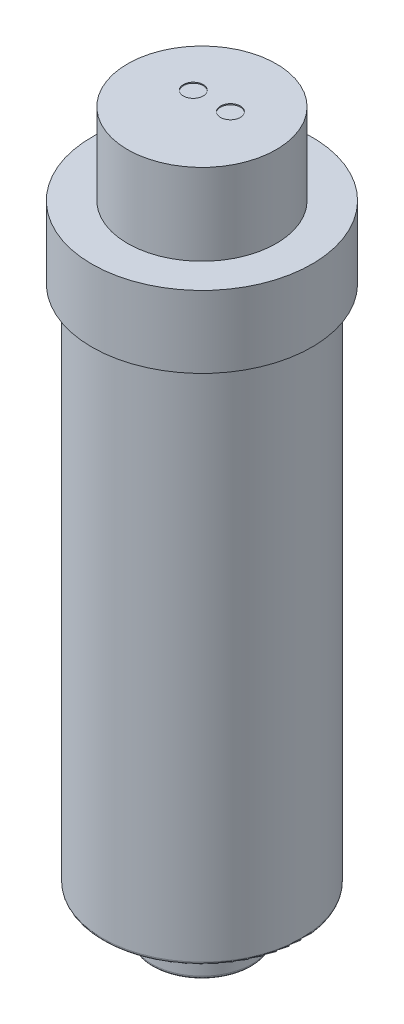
ISO-10303-21;
HEADER;
FILE_DESCRIPTION(('STEP AP214'),'2;1');
FILE_NAME('part.step','',(''),(''),'','','');
FILE_SCHEMA(('AUTOMOTIVE_DESIGN { 1 0 10303 214 1 1 1 1 }'));
ENDSEC;
DATA;
#1=APPLICATION_CONTEXT('core data for automotive mechanical design processes');
#2=APPLICATION_PROTOCOL_DEFINITION('international standard','automotive_design',2000,#1);
#3=PRODUCT_CONTEXT('',#1,'mechanical');
#4=PRODUCT('Part','Part','',(#3));
#5=PRODUCT_RELATED_PRODUCT_CATEGORY('part','',(#4));
#6=PRODUCT_DEFINITION_FORMATION('','',#4);
#7=PRODUCT_DEFINITION_CONTEXT('part definition',#1,'design');
#8=PRODUCT_DEFINITION('design','',#6,#7);
#9=PRODUCT_DEFINITION_SHAPE('','',#8);
#10=(LENGTH_UNIT() NAMED_UNIT(*) SI_UNIT(.MILLI.,.METRE.));
#11=(NAMED_UNIT(*) PLANE_ANGLE_UNIT() SI_UNIT($,.RADIAN.));
#12=(NAMED_UNIT(*) SI_UNIT($,.STERADIAN.) SOLID_ANGLE_UNIT());
#13=UNCERTAINTY_MEASURE_WITH_UNIT(LENGTH_MEASURE(1.E-05),#10,'distance_accuracy_value','');
#14=(GEOMETRIC_REPRESENTATION_CONTEXT(3) GLOBAL_UNCERTAINTY_ASSIGNED_CONTEXT((#13)) GLOBAL_UNIT_ASSIGNED_CONTEXT((#10,
#11,#12)) REPRESENTATION_CONTEXT('',''));
#15=CARTESIAN_POINT('',(0.,0.,0.));
#16=DIRECTION('',(0.,0.,1.));
#17=DIRECTION('',(1.,0.,0.));
#18=AXIS2_PLACEMENT_3D('',#15,#16,#17);
#19=CARTESIAN_POINT('',(0.,0.,0.));
#20=DIRECTION('',(0.,1.,0.));
#21=DIRECTION('',(0.,0.,1.));
#22=AXIS2_PLACEMENT_3D('',#19,#20,#21);
#23=PLANE('',#22);
#24=CARTESIAN_POINT('',(0.,0.,0.));
#25=DIRECTION('',(0.,1.,0.));
#26=DIRECTION('',(0.,0.,1.));
#27=AXIS2_PLACEMENT_3D('',#24,#25,#26);
#28=CIRCLE('',#27,24.63165);
#29=CARTESIAN_POINT('',(0.,0.,24.63165));
#30=VERTEX_POINT('',#29);
#31=EDGE_CURVE('E51',#30,#30,#28,.F.);
#32=ORIENTED_EDGE('',*,*,#31,.T.);
#33=EDGE_LOOP('',(#32));
#34=FACE_BOUND('',#33,.T.);
#35=CARTESIAN_POINT('',(0.,0.,0.));
#36=DIRECTION('',(0.,1.,0.));
#37=DIRECTION('',(0.,0.,1.));
#38=AXIS2_PLACEMENT_3D('',#35,#36,#37);
#39=CIRCLE('',#38,13.55725);
#40=CARTESIAN_POINT('',(0.,0.,13.55725));
#41=VERTEX_POINT('',#40);
#42=EDGE_CURVE('E56',#41,#41,#39,.T.);
#43=ORIENTED_EDGE('',*,*,#42,.T.);
#44=EDGE_LOOP('',(#43));
#45=FACE_BOUND('',#44,.T.);
#46=ADVANCED_FACE('F36',(#34,#45),#23,.F.);
#47=CARTESIAN_POINT('',(0.,151.765,0.));
#48=DIRECTION('',(0.,1.,0.));
#49=DIRECTION('',(0.,0.,1.));
#50=AXIS2_PLACEMENT_3D('',#47,#48,#49);
#51=PLANE('',#50);
#52=CARTESIAN_POINT('',(0.,151.765,0.));
#53=DIRECTION('',(0.,1.,0.));
#54=DIRECTION('',(0.,0.,1.));
#55=AXIS2_PLACEMENT_3D('',#52,#53,#54);
#56=CIRCLE('',#55,28.194);
#57=CARTESIAN_POINT('',(0.,151.765,28.194));
#58=VERTEX_POINT('',#57);
#59=EDGE_CURVE('E260',#58,#58,#56,.T.);
#60=ORIENTED_EDGE('',*,*,#59,.T.);
#61=EDGE_LOOP('',(#60));
#62=FACE_BOUND('',#61,.T.);
#63=CARTESIAN_POINT('',(0.,151.765,0.));
#64=DIRECTION('',(0.,1.,0.));
#65=DIRECTION('',(0.,0.,1.));
#66=AXIS2_PLACEMENT_3D('',#63,#64,#65);
#67=CIRCLE('',#66,19.05);
#68=CARTESIAN_POINT('',(0.,151.765,19.05));
#69=VERTEX_POINT('',#68);
#70=EDGE_CURVE('E266',#69,#69,#67,.T.);
#71=ORIENTED_EDGE('',*,*,#70,.F.);
#72=EDGE_LOOP('',(#71));
#73=FACE_BOUND('',#72,.T.);
#74=ADVANCED_FACE('F92',(#62,#73),#51,.T.);
#75=CARTESIAN_POINT('',(0.,133.35,0.));
#76=DIRECTION('',(0.,-1.,0.));
#77=DIRECTION('',(0.,0.,-1.));
#78=AXIS2_PLACEMENT_3D('',#75,#76,#77);
#79=CYLINDRICAL_SURFACE('',#78,25.4254);
#80=CARTESIAN_POINT('',(0.,0.79375000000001,0.));
#81=DIRECTION('',(0.,1.,0.));
#82=DIRECTION('',(0.,0.,1.));
#83=AXIS2_PLACEMENT_3D('',#80,#81,#82);
#84=CIRCLE('',#83,25.4254);
#85=CARTESIAN_POINT('',(0.,0.79375000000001,25.4254));
#86=VERTEX_POINT('',#85);
#87=EDGE_CURVE('E59',#86,#86,#84,.T.);
#88=ORIENTED_EDGE('',*,*,#87,.T.);
#89=EDGE_LOOP('',(#88));
#90=FACE_BOUND('',#89,.T.);
#91=CARTESIAN_POINT('',(0.,133.35,0.));
#92=DIRECTION('',(0.,1.,0.));
#93=DIRECTION('',(0.,0.,1.));
#94=AXIS2_PLACEMENT_3D('',#91,#92,#93);
#95=CIRCLE('',#94,25.4254);
#96=CARTESIAN_POINT('',(0.,133.35,25.4254));
#97=VERTEX_POINT('',#96);
#98=EDGE_CURVE('E62',#97,#97,#95,.T.);
#99=ORIENTED_EDGE('',*,*,#98,.F.);
#100=EDGE_LOOP('',(#99));
#101=FACE_BOUND('',#100,.T.);
#102=ADVANCED_FACE('F98',(#90,#101),#79,.T.);
#103=CARTESIAN_POINT('',(0.,133.35,0.));
#104=DIRECTION('',(0.,1.,0.));
#105=DIRECTION('',(0.,0.,1.));
#106=AXIS2_PLACEMENT_3D('',#103,#104,#105);
#107=PLANE('',#106);
#108=CARTESIAN_POINT('',(0.,133.35,0.));
#109=DIRECTION('',(0.,1.,0.));
#110=DIRECTION('',(0.,0.,1.));
#111=AXIS2_PLACEMENT_3D('',#108,#109,#110);
#112=CIRCLE('',#111,28.194);
#113=CARTESIAN_POINT('',(0.,133.35,28.194));
#114=VERTEX_POINT('',#113);
#115=EDGE_CURVE('E256',#114,#114,#112,.T.);
#116=ORIENTED_EDGE('',*,*,#115,.F.);
#117=EDGE_LOOP('',(#116));
#118=FACE_BOUND('',#117,.T.);
#119=ORIENTED_EDGE('',*,*,#98,.T.);
#120=EDGE_LOOP('',(#119));
#121=FACE_BOUND('',#120,.T.);
#122=ADVANCED_FACE('F108',(#118,#121),#107,.F.);
#123=CARTESIAN_POINT('',(0.,151.765,0.));
#124=DIRECTION('',(0.,-1.,0.));
#125=DIRECTION('',(0.,0.,-1.));
#126=AXIS2_PLACEMENT_3D('',#123,#124,#125);
#127=CYLINDRICAL_SURFACE('',#126,28.194);
#128=ORIENTED_EDGE('',*,*,#59,.F.);
#129=EDGE_LOOP('',(#128));
#130=FACE_BOUND('',#129,.T.);
#131=ORIENTED_EDGE('',*,*,#115,.T.);
#132=EDGE_LOOP('',(#131));
#133=FACE_BOUND('',#132,.T.);
#134=ADVANCED_FACE('F104',(#130,#133),#127,.T.);
#135=CARTESIAN_POINT('',(0.,172.593,0.));
#136=DIRECTION('',(0.,-1.,0.));
#137=DIRECTION('',(0.,0.,-1.));
#138=AXIS2_PLACEMENT_3D('',#135,#136,#137);
#139=CYLINDRICAL_SURFACE('',#138,19.05);
#140=CARTESIAN_POINT('',(0.,172.593,0.));
#141=DIRECTION('',(0.,1.,0.));
#142=DIRECTION('',(0.,0.,1.));
#143=AXIS2_PLACEMENT_3D('',#140,#141,#142);
#144=CIRCLE('',#143,19.05);
#145=CARTESIAN_POINT('',(0.,172.593,19.05));
#146=VERTEX_POINT('',#145);
#147=EDGE_CURVE('E264',#146,#146,#144,.T.);
#148=ORIENTED_EDGE('',*,*,#147,.F.);
#149=EDGE_LOOP('',(#148));
#150=FACE_BOUND('',#149,.T.);
#151=ORIENTED_EDGE('',*,*,#70,.T.);
#152=EDGE_LOOP('',(#151));
#153=FACE_BOUND('',#152,.T.);
#154=ADVANCED_FACE('F217',(#150,#153),#139,.T.);
#155=CARTESIAN_POINT('',(0.,172.593,0.));
#156=DIRECTION('',(0.,1.,0.));
#157=DIRECTION('',(0.,0.,1.));
#158=AXIS2_PLACEMENT_3D('',#155,#156,#157);
#159=PLANE('',#158);
#160=CARTESIAN_POINT('',(4.7625,172.593,-2.54));
#161=DIRECTION('',(0.,1.,0.));
#162=DIRECTION('',(0.,0.,1.));
#163=AXIS2_PLACEMENT_3D('',#160,#161,#162);
#164=CIRCLE('',#163,2.54);
#165=CARTESIAN_POINT('',(4.7625,172.593,0.));
#166=VERTEX_POINT('',#165);
#167=EDGE_CURVE('E70',#166,#166,#164,.T.);
#168=ORIENTED_EDGE('',*,*,#167,.F.);
#169=EDGE_LOOP('',(#168));
#170=FACE_BOUND('',#169,.T.);
#171=CARTESIAN_POINT('',(-4.7625,172.593,-2.54));
#172=DIRECTION('',(0.,1.,0.));
#173=DIRECTION('',(0.,0.,1.));
#174=AXIS2_PLACEMENT_3D('',#171,#172,#173);
#175=CIRCLE('',#174,2.54);
#176=CARTESIAN_POINT('',(-4.7625,172.593,0.));
#177=VERTEX_POINT('',#176);
#178=EDGE_CURVE('E272',#177,#177,#175,.T.);
#179=ORIENTED_EDGE('',*,*,#178,.F.);
#180=EDGE_LOOP('',(#179));
#181=FACE_BOUND('',#180,.T.);
#182=ORIENTED_EDGE('',*,*,#147,.T.);
#183=EDGE_LOOP('',(#182));
#184=FACE_BOUND('',#183,.T.);
#185=ADVANCED_FACE('F207',(#170,#181,#184),#159,.T.);
#186=CARTESIAN_POINT('',(-4.7625,172.339,-2.54));
#187=DIRECTION('',(0.,1.,0.));
#188=DIRECTION('',(0.,0.,1.));
#189=AXIS2_PLACEMENT_3D('',#186,#187,#188);
#190=CYLINDRICAL_SURFACE('',#189,2.54);
#191=CARTESIAN_POINT('',(-4.7625,172.339,-2.54));
#192=DIRECTION('',(0.,1.,0.));
#193=DIRECTION('',(0.,0.,1.));
#194=AXIS2_PLACEMENT_3D('',#191,#192,#193);
#195=CIRCLE('',#194,2.54);
#196=CARTESIAN_POINT('',(-4.7625,172.339,0.));
#197=VERTEX_POINT('',#196);
#198=EDGE_CURVE('E269',#197,#197,#195,.T.);
#199=ORIENTED_EDGE('',*,*,#198,.F.);
#200=EDGE_LOOP('',(#199));
#201=FACE_BOUND('',#200,.T.);
#202=ORIENTED_EDGE('',*,*,#178,.T.);
#203=EDGE_LOOP('',(#202));
#204=FACE_BOUND('',#203,.T.);
#205=ADVANCED_FACE('F197',(#201,#204),#190,.F.);
#206=CARTESIAN_POINT('',(-4.7625,172.339,-2.54));
#207=DIRECTION('',(0.,1.,0.));
#208=DIRECTION('',(0.,0.,1.));
#209=AXIS2_PLACEMENT_3D('',#206,#207,#208);
#210=PLANE('',#209);
#211=ORIENTED_EDGE('',*,*,#198,.T.);
#212=EDGE_LOOP('',(#211));
#213=FACE_BOUND('',#212,.T.);
#214=ADVANCED_FACE('F187',(#213),#210,.T.);
#215=CARTESIAN_POINT('',(4.7625,172.339,-2.54));
#216=DIRECTION('',(0.,1.,0.));
#217=DIRECTION('',(0.,0.,1.));
#218=AXIS2_PLACEMENT_3D('',#215,#216,#217);
#219=CYLINDRICAL_SURFACE('',#218,2.54);
#220=CARTESIAN_POINT('',(4.7625,172.339,-2.54));
#221=DIRECTION('',(0.,1.,0.));
#222=DIRECTION('',(0.,0.,1.));
#223=AXIS2_PLACEMENT_3D('',#220,#221,#222);
#224=CIRCLE('',#223,2.54);
#225=CARTESIAN_POINT('',(4.7625,172.339,0.));
#226=VERTEX_POINT('',#225);
#227=EDGE_CURVE('E275',#226,#226,#224,.T.);
#228=ORIENTED_EDGE('',*,*,#227,.F.);
#229=EDGE_LOOP('',(#228));
#230=FACE_BOUND('',#229,.T.);
#231=ORIENTED_EDGE('',*,*,#167,.T.);
#232=EDGE_LOOP('',(#231));
#233=FACE_BOUND('',#232,.T.);
#234=ADVANCED_FACE('F178',(#230,#233),#219,.F.);
#235=CARTESIAN_POINT('',(4.7625,172.339,-2.54));
#236=DIRECTION('',(0.,1.,0.));
#237=DIRECTION('',(0.,0.,1.));
#238=AXIS2_PLACEMENT_3D('',#235,#236,#237);
#239=PLANE('',#238);
#240=ORIENTED_EDGE('',*,*,#227,.T.);
#241=EDGE_LOOP('',(#240));
#242=FACE_BOUND('',#241,.T.);
#243=ADVANCED_FACE('F90',(#242),#239,.T.);
#244=CARTESIAN_POINT('',(0.,-12.065,0.));
#245=DIRECTION('',(0.,1.,0.));
#246=DIRECTION('',(0.,0.,1.));
#247=AXIS2_PLACEMENT_3D('',#244,#245,#246);
#248=CYLINDRICAL_SURFACE('',#247,12.7635);
#249=CARTESIAN_POINT('',(0.,-0.793749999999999,0.));
#250=DIRECTION('',(0.,1.,0.));
#251=DIRECTION('',(0.,0.,1.));
#252=AXIS2_PLACEMENT_3D('',#249,#250,#251);
#253=CIRCLE('',#252,12.7635);
#254=CARTESIAN_POINT('',(0.,-0.793749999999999,12.7635));
#255=VERTEX_POINT('',#254);
#256=EDGE_CURVE('E43',#255,#255,#253,.F.);
#257=ORIENTED_EDGE('',*,*,#256,.T.);
#258=EDGE_LOOP('',(#257));
#259=FACE_BOUND('',#258,.T.);
#260=CARTESIAN_POINT('',(0.,-11.27125,0.));
#261=DIRECTION('',(0.,-1.,0.));
#262=DIRECTION('',(0.,0.,-1.));
#263=AXIS2_PLACEMENT_3D('',#260,#261,#262);
#264=CIRCLE('',#263,12.7635);
#265=CARTESIAN_POINT('',(0.,-11.27125,-12.7635));
#266=VERTEX_POINT('',#265);
#267=EDGE_CURVE('E47',#266,#266,#264,.F.);
#268=ORIENTED_EDGE('',*,*,#267,.T.);
#269=EDGE_LOOP('',(#268));
#270=FACE_BOUND('',#269,.T.);
#271=CARTESIAN_POINT('',(0.,-9.0551,12.7635));
#272=CARTESIAN_POINT('',(-0.184256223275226,-9.05509537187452,12.763497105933));
#273=CARTESIAN_POINT('',(-0.368562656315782,-9.03980211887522,12.7594706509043));
#274=CARTESIAN_POINT('',(-0.731874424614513,-8.9791363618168,12.7437990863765));
#275=CARTESIAN_POINT('',(-0.910877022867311,-8.93374860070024,12.7321501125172));
#276=CARTESIAN_POINT('',(-1.25828367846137,-8.81446427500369,12.7025205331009));
#277=CARTESIAN_POINT('',(-1.42670080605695,-8.74060370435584,12.6845479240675));
#278=CARTESIAN_POINT('',(-1.74875630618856,-8.56660176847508,12.644174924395));
#279=CARTESIAN_POINT('',(-1.90239383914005,-8.46645891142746,12.6217742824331));
#280=CARTESIAN_POINT('',(-2.19397048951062,-8.24036634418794,12.5744067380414));
#281=CARTESIAN_POINT('',(-2.33153136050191,-8.1139377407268,12.5493972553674));
#282=CARTESIAN_POINT('',(-2.58375949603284,-7.83988672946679,12.4999070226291));
#283=CARTESIAN_POINT('',(-2.69842392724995,-7.69226170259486,12.4754263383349));
#284=CARTESIAN_POINT('',(-2.90342857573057,-7.37701427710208,12.4293318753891));
#285=CARTESIAN_POINT('',(-2.99333731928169,-7.20910270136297,12.4077719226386));
#286=CARTESIAN_POINT('',(-3.14350063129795,-6.85989180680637,12.3705845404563));
#287=CARTESIAN_POINT('',(-3.20376044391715,-6.67859486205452,12.354956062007));
#288=CARTESIAN_POINT('',(-3.29160878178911,-6.31193966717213,12.3318401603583));
#289=CARTESIAN_POINT('',(-3.31988137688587,-6.12675630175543,12.3241825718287));
#290=CARTESIAN_POINT('',(-3.34508484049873,-5.75412878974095,12.3173667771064));
#291=CARTESIAN_POINT('',(-3.34202133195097,-5.56668505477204,12.3182070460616));
#292=CARTESIAN_POINT('',(-3.30518345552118,-5.20016730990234,12.3281395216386));
#293=CARTESIAN_POINT('',(-3.27223295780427,-5.02100354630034,12.3370103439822));
#294=CARTESIAN_POINT('',(-3.17787437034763,-4.67084010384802,12.3616504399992));
#295=CARTESIAN_POINT('',(-3.11646408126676,-4.49984105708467,12.3774202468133));
#296=CARTESIAN_POINT('',(-2.96624846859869,-4.16869481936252,12.4142787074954));
#297=CARTESIAN_POINT('',(-2.87715122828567,-4.00868656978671,12.4354235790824));
#298=CARTESIAN_POINT('',(-2.67429465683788,-3.70560076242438,12.4806189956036));
#299=CARTESIAN_POINT('',(-2.56053063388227,-3.56252643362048,12.5046700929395));
#300=CARTESIAN_POINT('',(-2.30734054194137,-3.29265832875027,12.5538927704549));
#301=CARTESIAN_POINT('',(-2.16722157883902,-3.16651583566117,12.5790758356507));
#302=CARTESIAN_POINT('',(-1.86751249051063,-2.93938865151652,12.6270474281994));
#303=CARTESIAN_POINT('',(-1.7079216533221,-2.83840488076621,12.6498358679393));
#304=CARTESIAN_POINT('',(-1.37281465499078,-2.66418958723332,12.6905823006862));
#305=CARTESIAN_POINT('',(-1.19723655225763,-2.59107223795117,12.708520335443));
#306=CARTESIAN_POINT('',(-0.835704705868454,-2.47557786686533,12.7374003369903));
#307=CARTESIAN_POINT('',(-0.649753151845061,-2.43319438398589,12.7483437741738));
#308=CARTESIAN_POINT('',(-0.278314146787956,-2.38138492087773,12.761780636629));
#309=CARTESIAN_POINT('',(-0.0929582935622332,-2.37107303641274,12.7645011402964));
#310=CARTESIAN_POINT('',(0.276833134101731,-2.38125805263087,12.7618366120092));
#311=CARTESIAN_POINT('',(0.461268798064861,-2.40175189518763,12.7564523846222));
#312=CARTESIAN_POINT('',(0.820847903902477,-2.47223882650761,12.7383297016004));
#313=CARTESIAN_POINT('',(0.996094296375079,-2.52174108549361,12.7257136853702));
#314=CARTESIAN_POINT('',(1.33578103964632,-2.64827253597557,12.6945555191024));
#315=CARTESIAN_POINT('',(1.50022024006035,-2.72530465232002,12.6760127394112));
#316=CARTESIAN_POINT('',(1.81709225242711,-2.90637474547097,12.6345221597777));
#317=CARTESIAN_POINT('',(1.96923683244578,-3.01089901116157,12.6114972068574));
#318=CARTESIAN_POINT('',(2.25413866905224,-3.24337191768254,12.5637054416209));
#319=CARTESIAN_POINT('',(2.38689223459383,-3.37132500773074,12.5389382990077));
#320=CARTESIAN_POINT('',(2.63295189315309,-3.65115172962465,12.489623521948));
#321=CARTESIAN_POINT('',(2.74563397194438,-3.80357931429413,12.4650999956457));
#322=CARTESIAN_POINT('',(2.94382912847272,-4.12569480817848,12.4197897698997));
#323=CARTESIAN_POINT('',(3.02934336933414,-4.2953819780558,12.3990029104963));
#324=CARTESIAN_POINT('',(3.17013184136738,-4.64632934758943,12.3637561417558));
#325=CARTESIAN_POINT('',(3.22558309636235,-4.8275146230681,12.3492592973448));
#326=CARTESIAN_POINT('',(3.30510643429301,-5.19707927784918,12.3282167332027));
#327=CARTESIAN_POINT('',(3.3291861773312,-5.38545688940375,12.3216690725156));
#328=CARTESIAN_POINT('',(3.34485442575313,-5.7576822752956,12.317424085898));
#329=CARTESIAN_POINT('',(3.33744412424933,-5.94148543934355,12.3194540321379));
#330=CARTESIAN_POINT('',(3.29265560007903,-6.3051232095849,12.331499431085));
#331=CARTESIAN_POINT('',(3.2552780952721,-6.48495791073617,12.3415146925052));
#332=CARTESIAN_POINT('',(3.1521866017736,-6.83434612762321,12.3682430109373));
#333=CARTESIAN_POINT('',(3.08667734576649,-7.00396401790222,12.3849076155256));
#334=CARTESIAN_POINT('',(2.92934161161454,-7.32992784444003,12.4230597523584));
#335=CARTESIAN_POINT('',(2.83751114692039,-7.48627176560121,12.444548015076));
#336=CARTESIAN_POINT('',(2.62707364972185,-7.78604671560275,12.4906890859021));
#337=CARTESIAN_POINT('',(2.50777987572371,-7.92898455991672,12.5154144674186));
#338=CARTESIAN_POINT('',(2.24711797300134,-8.19313846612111,12.5648302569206));
#339=CARTESIAN_POINT('',(2.10574452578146,-8.31434927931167,12.5895206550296));
#340=CARTESIAN_POINT('',(1.80146098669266,-8.53402975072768,12.6366856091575));
#341=CARTESIAN_POINT('',(1.63817084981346,-8.63198586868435,12.6591047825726));
#342=CARTESIAN_POINT('',(1.29686226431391,-8.79890179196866,12.6986023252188));
#343=CARTESIAN_POINT('',(1.11885370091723,-8.86788087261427,12.7156842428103));
#344=CARTESIAN_POINT('',(0.784498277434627,-8.96550640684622,12.7402765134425));
#345=CARTESIAN_POINT('',(0.629640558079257,-8.99902764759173,12.7489229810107));
#346=CARTESIAN_POINT('',(0.31653403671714,-9.04382541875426,12.7605357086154));
#347=CARTESIAN_POINT('',(0.158285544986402,-9.05510397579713,12.7635024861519));
#348=CARTESIAN_POINT('',(0.,-9.0551,12.7635));
#349=B_SPLINE_CURVE_WITH_KNOTS('',3,(#271,#272,#273,#274,#275,#276,#277,#278,#279,#280,#281,
#282,#283,#284,#285,#286,#287,#288,#289,#290,#291,#292,#293,#294,#295,#296,#297,#298,#299,#300,
#301,#302,#303,#304,#305,#306,#307,#308,#309,#310,#311,#312,#313,#314,#315,#316,#317,#318,#319,
#320,#321,#322,#323,#324,#325,#326,#327,#328,#329,#330,#331,#332,#333,#334,#335,#336,#337,#338,
#339,#340,#341,#342,#343,#344,#345,#346,#347,#348),.UNSPECIFIED.,.T.,.F.,(4,2,2,2,2,2,2,2,2,2,2,
2,2,2,2,2,2,2,2,2,2,2,2,2,2,2,2,2,2,2,2,2,2,2,2,2,2,2,4),(0.,0.552188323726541,1.10465680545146,
1.65642916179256,2.20823284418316,2.77114385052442,3.33412447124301,3.90637237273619,
4.478519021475,5.03818385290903,5.59774826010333,6.1423413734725,6.6869765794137,
7.23756099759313,7.78825023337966,8.35620948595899,8.92418951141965,9.49447225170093,
10.0646350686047,10.6189018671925,11.1731136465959,11.718208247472,12.2633607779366,
12.81889353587,13.3745319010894,13.9452174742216,14.5158786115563,15.083141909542,
15.6502666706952,16.1994974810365,16.7487151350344,17.2940017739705,17.8393710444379,
18.4002377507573,18.9612397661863,19.5336695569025,20.1057179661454,20.5801192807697,
21.0544773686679),.UNSPECIFIED.);
#350=CARTESIAN_POINT('',(0.,-9.0551,12.7635));
#351=VERTEX_POINT('',#350);
#352=EDGE_CURVE('E63',#351,#351,#349,.T.);
#353=ORIENTED_EDGE('',*,*,#352,.T.);
#354=EDGE_LOOP('',(#353));
#355=FACE_BOUND('',#354,.T.);
#356=CARTESIAN_POINT('',(3.3401,-5.715,-12.3187119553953));
#357=CARTESIAN_POINT('',(3.34009530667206,-5.53086561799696,-12.3187152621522));
#358=CARTESIAN_POINT('',(3.32482157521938,-5.34668089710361,-12.3228856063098));
#359=CARTESIAN_POINT('',(3.26424037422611,-4.98362155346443,-12.3390687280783));
#360=CARTESIAN_POINT('',(3.21891710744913,-4.80474977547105,-12.3510856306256));
#361=CARTESIAN_POINT('',(3.09982123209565,-4.45762066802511,-12.3815097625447));
#362=CARTESIAN_POINT('',(3.0260876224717,-4.28934915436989,-12.3999082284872));
#363=CARTESIAN_POINT('',(2.85238525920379,-3.96754060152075,-12.4410113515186));
#364=CARTESIAN_POINT('',(2.75241474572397,-3.81400455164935,-12.4637162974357));
#365=CARTESIAN_POINT('',(2.52650153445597,-3.52232587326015,-12.5114869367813));
#366=CARTESIAN_POINT('',(2.40004112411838,-3.38459079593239,-12.5365932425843));
#367=CARTESIAN_POINT('',(2.12585181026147,-3.13202287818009,-12.5859866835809));
#368=CARTESIAN_POINT('',(1.97812077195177,-3.01719233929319,-12.6102737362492));
#369=CARTESIAN_POINT('',(1.66276808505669,-2.81200340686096,-12.6557441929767));
#370=CARTESIAN_POINT('',(1.49487537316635,-2.72204872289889,-12.6768740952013));
#371=CARTESIAN_POINT('',(1.14570473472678,-2.57179541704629,-12.7131843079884));
#372=CARTESIAN_POINT('',(0.964428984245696,-2.51149198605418,-12.7283655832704));
#373=CARTESIAN_POINT('',(0.597890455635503,-2.42356784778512,-12.7507808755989));
#374=CARTESIAN_POINT('',(0.41280436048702,-2.39525422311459,-12.7581831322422));
#375=CARTESIAN_POINT('',(0.0403711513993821,-2.36993490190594,-12.7647939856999));
#376=CARTESIAN_POINT('',(-0.146975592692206,-2.37292415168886,-12.7640039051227));
#377=CARTESIAN_POINT('',(-0.513794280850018,-2.40963459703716,-12.7544429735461));
#378=CARTESIAN_POINT('',(-0.693346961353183,-2.44260737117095,-12.7458664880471));
#379=CARTESIAN_POINT('',(-1.04427622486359,-2.53714164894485,-12.7219248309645));
#380=CARTESIAN_POINT('',(-1.21565234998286,-2.59870475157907,-12.7065592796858));
#381=CARTESIAN_POINT('',(-1.54729295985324,-2.74925542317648,-12.670474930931));
#382=CARTESIAN_POINT('',(-1.70743396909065,-2.8385024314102,-12.6497058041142));
#383=CARTESIAN_POINT('',(-2.01072393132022,-3.04168911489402,-12.6050567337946));
#384=CARTESIAN_POINT('',(-2.15386967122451,-3.1556334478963,-12.5811762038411));
#385=CARTESIAN_POINT('',(-2.42357193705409,-3.40896532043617,-12.5320628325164));
#386=CARTESIAN_POINT('',(-2.54951216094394,-3.54900602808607,-12.506810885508));
#387=CARTESIAN_POINT('',(-2.77626673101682,-3.84848219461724,-12.4584411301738));
#388=CARTESIAN_POINT('',(-2.87707965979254,-4.00791874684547,-12.4353234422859));
#389=CARTESIAN_POINT('',(-3.05116409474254,-4.34295815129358,-12.3937654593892));
#390=CARTESIAN_POINT('',(-3.1242739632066,-4.51864865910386,-12.3753528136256));
#391=CARTESIAN_POINT('',(-3.23972032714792,-4.88042822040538,-12.3456363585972));
#392=CARTESIAN_POINT('',(-3.28206413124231,-5.06651479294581,-12.3343308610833));
#393=CARTESIAN_POINT('',(-3.33372614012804,-5.43805504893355,-12.3204668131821));
#394=CARTESIAN_POINT('',(-3.34396121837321,-5.62337232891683,-12.3176655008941));
#395=CARTESIAN_POINT('',(-3.33363651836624,-5.99306937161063,-12.3204638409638));
#396=CARTESIAN_POINT('',(-3.3130798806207,-6.17744922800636,-12.3260626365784));
#397=CARTESIAN_POINT('',(-3.2425622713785,-6.5365441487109,-12.3447964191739));
#398=CARTESIAN_POINT('',(-3.19314714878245,-6.71137441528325,-12.3577913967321));
#399=CARTESIAN_POINT('',(-3.06692641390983,-7.05026685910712,-12.389717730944));
#400=CARTESIAN_POINT('',(-2.99011732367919,-7.21432766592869,-12.4086498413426));
#401=CARTESIAN_POINT('',(-2.80941007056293,-7.53087501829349,-12.4508194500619));
#402=CARTESIAN_POINT('',(-2.70497051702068,-7.68304119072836,-12.4741399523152));
#403=CARTESIAN_POINT('',(-2.47264216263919,-7.96802490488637,-12.5222609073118));
#404=CARTESIAN_POINT('',(-2.34474912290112,-8.10083894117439,-12.5470616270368));
#405=CARTESIAN_POINT('',(-2.06491330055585,-8.34712626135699,-12.5961803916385));
#406=CARTESIAN_POINT('',(-1.91240234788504,-8.45996170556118,-12.6204660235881));
#407=CARTESIAN_POINT('',(-1.59006970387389,-8.65842660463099,-12.6651112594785));
#408=CARTESIAN_POINT('',(-1.42024893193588,-8.74405750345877,-12.6854710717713));
#409=CARTESIAN_POINT('',(-1.06930946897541,-8.88490798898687,-12.7198399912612));
#410=CARTESIAN_POINT('',(-0.888285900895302,-8.94035260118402,-12.7338959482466));
#411=CARTESIAN_POINT('',(-0.519070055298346,-9.01991701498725,-12.7542793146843));
#412=CARTESIAN_POINT('',(-0.330879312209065,-9.04404348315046,-12.7606083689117));
#413=CARTESIAN_POINT('',(0.0413599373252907,-9.05988199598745,-12.7647503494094));
#414=CARTESIAN_POINT('',(0.225366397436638,-9.05253135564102,-12.7628095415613));
#415=CARTESIAN_POINT('',(0.589427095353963,-9.00779168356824,-12.7511834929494));
#416=CARTESIAN_POINT('',(0.769481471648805,-8.97040370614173,-12.741498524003));
#417=CARTESIAN_POINT('',(1.11944386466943,-8.86717261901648,-12.715518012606));
#418=CARTESIAN_POINT('',(1.28940951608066,-8.80151342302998,-12.6992652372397));
#419=CARTESIAN_POINT('',(1.61600872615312,-8.64376852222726,-12.661852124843));
#420=CARTESIAN_POINT('',(1.77264046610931,-8.55167921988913,-12.6406911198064));
#421=CARTESIAN_POINT('',(2.07251431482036,-8.34090978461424,-12.5950480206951));
#422=CARTESIAN_POINT('',(2.21530554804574,-8.22160372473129,-12.5704942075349));
#423=CARTESIAN_POINT('',(2.47915824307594,-7.96098312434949,-12.521132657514));
#424=CARTESIAN_POINT('',(2.60021404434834,-7.81966286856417,-12.4963248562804));
#425=CARTESIAN_POINT('',(2.8196650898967,-7.51546161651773,-12.4486675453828));
#426=CARTESIAN_POINT('',(2.91753227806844,-7.35219084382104,-12.4258699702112));
#427=CARTESIAN_POINT('',(3.08428682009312,-7.01093711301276,-12.3855366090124));
#428=CARTESIAN_POINT('',(3.1531937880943,-6.83296421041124,-12.3679972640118));
#429=CARTESIAN_POINT('',(3.25067101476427,-6.49878259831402,-12.3426955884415));
#430=CARTESIAN_POINT('',(3.28412989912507,-6.34407024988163,-12.3337729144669));
#431=CARTESIAN_POINT('',(3.32884524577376,-6.03125074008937,-12.3217799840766));
#432=CARTESIAN_POINT('',(3.3401040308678,-5.87314393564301,-12.318709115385));
#433=CARTESIAN_POINT('',(3.3401,-5.715,-12.3187119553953));
#434=B_SPLINE_CURVE_WITH_KNOTS('',3,(#356,#357,#358,#359,#360,#361,#362,#363,#364,#365,#366,
#367,#368,#369,#370,#371,#372,#373,#374,#375,#376,#377,#378,#379,#380,#381,#382,#383,#384,#385,
#386,#387,#388,#389,#390,#391,#392,#393,#394,#395,#396,#397,#398,#399,#400,#401,#402,#403,#404,
#405,#406,#407,#408,#409,#410,#411,#412,#413,#414,#415,#416,#417,#418,#419,#420,#421,#422,#423,
#424,#425,#426,#427,#428,#429,#430,#431,#432,#433),.UNSPECIFIED.,.T.,.F.,(4,2,2,2,2,2,2,2,2,2,2,
2,2,2,2,2,2,2,2,2,2,2,2,2,2,2,2,2,2,2,2,2,2,2,2,2,2,2,4),(0.,0.551821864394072,1.10393405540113,
1.65529104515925,2.20668502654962,2.77007462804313,3.33352081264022,3.90563612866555,
4.47765862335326,5.03703785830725,5.59632678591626,6.14202734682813,6.68775843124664,
7.23876676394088,7.78987910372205,8.35730091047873,8.9247547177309,9.49547022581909,
10.0660501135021,10.6201812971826,11.1742559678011,11.7181751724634,12.2621634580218,
12.817721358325,13.3733797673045,13.9444339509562,14.5154578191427,15.0821645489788,
15.6487506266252,16.1985842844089,16.7483986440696,17.2946890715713,17.8410538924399,
18.401544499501,18.9621808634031,19.5345663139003,20.1065634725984,20.5805456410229,
21.0544782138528),.UNSPECIFIED.);
#435=CARTESIAN_POINT('',(3.3401,-5.715,-12.3187119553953));
#436=VERTEX_POINT('',#435);
#437=EDGE_CURVE('E71',#436,#436,#434,.T.);
#438=ORIENTED_EDGE('',*,*,#437,.T.);
#439=EDGE_LOOP('',(#438));
#440=FACE_BOUND('',#439,.T.);
#441=ADVANCED_FACE('F75',(#259,#270,#355,#440),#248,.T.);
#442=CARTESIAN_POINT('',(0.,-12.065,0.));
#443=DIRECTION('',(0.,-1.,0.));
#444=DIRECTION('',(0.,0.,-1.));
#445=AXIS2_PLACEMENT_3D('',#442,#443,#444);
#446=PLANE('',#445);
#447=CARTESIAN_POINT('',(0.,-12.065,0.));
#448=DIRECTION('',(0.,-1.,0.));
#449=DIRECTION('',(0.,0.,-1.));
#450=AXIS2_PLACEMENT_3D('',#447,#448,#449);
#451=CIRCLE('',#450,11.96975);
#452=CARTESIAN_POINT('',(0.,-12.065,-11.96975));
#453=VERTEX_POINT('',#452);
#454=EDGE_CURVE('E10',#453,#453,#451,.T.);
#455=ORIENTED_EDGE('',*,*,#454,.T.);
#456=EDGE_LOOP('',(#455));
#457=FACE_BOUND('',#456,.T.);
#458=ADVANCED_FACE('F83',(#457),#446,.T.);
#459=CARTESIAN_POINT('',(0.,-5.715,-28.194));
#460=DIRECTION('',(0.,0.,1.));
#461=DIRECTION('',(1.,0.,0.));
#462=AXIS2_PLACEMENT_3D('',#459,#460,#461);
#463=CYLINDRICAL_SURFACE('',#462,3.3401);
#464=ORIENTED_EDGE('',*,*,#437,.F.);
#465=EDGE_LOOP('',(#464));
#466=FACE_BOUND('',#465,.T.);
#467=ORIENTED_EDGE('',*,*,#352,.F.);
#468=EDGE_LOOP('',(#467));
#469=FACE_BOUND('',#468,.T.);
#470=ADVANCED_FACE('F79',(#466,#469),#463,.F.);
#471=CARTESIAN_POINT('',(0.,0.79375000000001,0.));
#472=DIRECTION('',(0.,1.,0.));
#473=DIRECTION('',(0.,0.,1.));
#474=AXIS2_PLACEMENT_3D('',#471,#472,#473);
#475=TOROIDAL_SURFACE('',#474,24.63165,0.79375);
#476=ORIENTED_EDGE('',*,*,#31,.F.);
#477=EDGE_LOOP('',(#476));
#478=FACE_BOUND('',#477,.T.);
#479=ORIENTED_EDGE('',*,*,#87,.F.);
#480=EDGE_LOOP('',(#479));
#481=FACE_BOUND('',#480,.T.);
#482=ADVANCED_FACE('F82',(#478,#481),#475,.T.);
#483=CARTESIAN_POINT('',(0.,-0.793749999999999,0.));
#484=DIRECTION('',(0.,1.,0.));
#485=DIRECTION('',(0.,0.,1.));
#486=AXIS2_PLACEMENT_3D('',#483,#484,#485);
#487=TOROIDAL_SURFACE('',#486,13.55725,0.79375);
#488=ORIENTED_EDGE('',*,*,#42,.F.);
#489=EDGE_LOOP('',(#488));
#490=FACE_BOUND('',#489,.T.);
#491=ORIENTED_EDGE('',*,*,#256,.F.);
#492=EDGE_LOOP('',(#491));
#493=FACE_BOUND('',#492,.T.);
#494=ADVANCED_FACE('F111',(#490,#493),#487,.F.);
#495=CARTESIAN_POINT('',(0.,-11.27125,0.));
#496=DIRECTION('',(0.,-1.,0.));
#497=DIRECTION('',(0.,0.,-1.));
#498=AXIS2_PLACEMENT_3D('',#495,#496,#497);
#499=TOROIDAL_SURFACE('',#498,11.96975,0.79375);
#500=ORIENTED_EDGE('',*,*,#267,.F.);
#501=EDGE_LOOP('',(#500));
#502=FACE_BOUND('',#501,.T.);
#503=ORIENTED_EDGE('',*,*,#454,.F.);
#504=EDGE_LOOP('',(#503));
#505=FACE_BOUND('',#504,.T.);
#506=ADVANCED_FACE('F38',(#502,#505),#499,.T.);
#507=CLOSED_SHELL('',(#46,#74,#102,#122,#134,#154,#185,#205,#214,#234,#243,#441,#458,#470,#482,
#494,#506));
#508=MANIFOLD_SOLID_BREP('B2',#507);
#509=ADVANCED_BREP_SHAPE_REPRESENTATION('',(#18,#508),#14);
#510=SHAPE_DEFINITION_REPRESENTATION(#9,#509);
ENDSEC;
END-ISO-10303-21;
